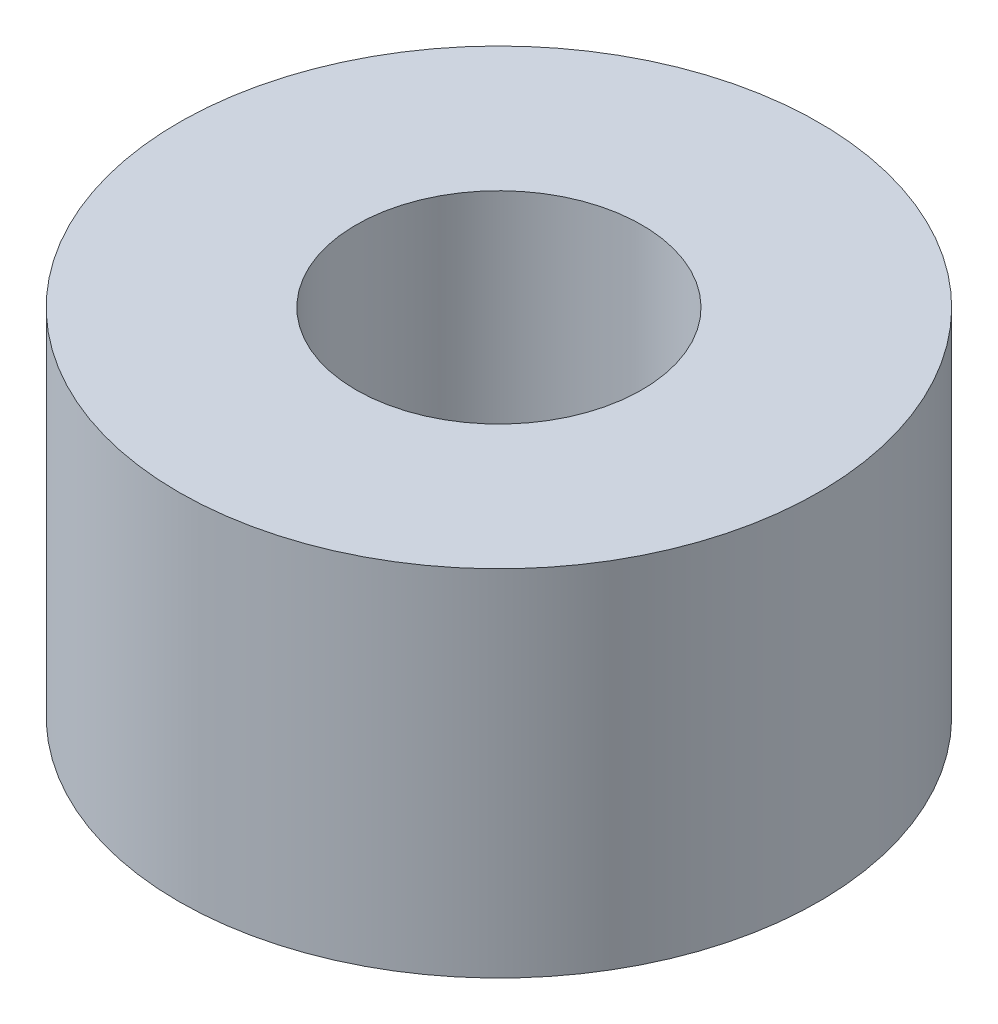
ISO-10303-21;
HEADER;
FILE_DESCRIPTION(('STEP AP214'),'2;1');
FILE_NAME('part.step','',(''),(''),'','','');
FILE_SCHEMA(('AUTOMOTIVE_DESIGN { 1 0 10303 214 1 1 1 1 }'));
ENDSEC;
DATA;
#1=APPLICATION_CONTEXT('core data for automotive mechanical design processes');
#2=APPLICATION_PROTOCOL_DEFINITION('international standard','automotive_design',2000,#1);
#3=PRODUCT_CONTEXT('',#1,'mechanical');
#4=PRODUCT('Part','Part','',(#3));
#5=PRODUCT_RELATED_PRODUCT_CATEGORY('part','',(#4));
#6=PRODUCT_DEFINITION_FORMATION('','',#4);
#7=PRODUCT_DEFINITION_CONTEXT('part definition',#1,'design');
#8=PRODUCT_DEFINITION('design','',#6,#7);
#9=PRODUCT_DEFINITION_SHAPE('','',#8);
#10=(LENGTH_UNIT() NAMED_UNIT(*) SI_UNIT(.MILLI.,.METRE.));
#11=(NAMED_UNIT(*) PLANE_ANGLE_UNIT() SI_UNIT($,.RADIAN.));
#12=(NAMED_UNIT(*) SI_UNIT($,.STERADIAN.) SOLID_ANGLE_UNIT());
#13=UNCERTAINTY_MEASURE_WITH_UNIT(LENGTH_MEASURE(1.E-05),#10,'distance_accuracy_value','');
#14=(GEOMETRIC_REPRESENTATION_CONTEXT(3) GLOBAL_UNCERTAINTY_ASSIGNED_CONTEXT((#13)) GLOBAL_UNIT_ASSIGNED_CONTEXT((#10,
#11,#12)) REPRESENTATION_CONTEXT('',''));
#15=CARTESIAN_POINT('',(0.,0.,0.));
#16=DIRECTION('',(0.,0.,1.));
#17=DIRECTION('',(1.,0.,0.));
#18=AXIS2_PLACEMENT_3D('',#15,#16,#17);
#19=CARTESIAN_POINT('',(0.,15.5,0.));
#20=DIRECTION('',(0.,1.,0.));
#21=DIRECTION('',(0.,0.,1.));
#22=AXIS2_PLACEMENT_3D('',#19,#20,#21);
#23=PLANE('',#22);
#24=CARTESIAN_POINT('',(0.,15.5,0.));
#25=DIRECTION('',(0.,1.,0.));
#26=DIRECTION('',(0.,0.,1.));
#27=AXIS2_PLACEMENT_3D('',#24,#25,#26);
#28=CIRCLE('',#27,14.);
#29=CARTESIAN_POINT('',(0.,15.5,14.));
#30=VERTEX_POINT('',#29);
#31=EDGE_CURVE('E10',#30,#30,#28,.T.);
#32=ORIENTED_EDGE('',*,*,#31,.T.);
#33=EDGE_LOOP('',(#32));
#34=FACE_BOUND('',#33,.T.);
#35=CARTESIAN_POINT('',(0.,15.5,0.));
#36=DIRECTION('',(0.,1.,0.));
#37=DIRECTION('',(0.,0.,1.));
#38=AXIS2_PLACEMENT_3D('',#35,#36,#37);
#39=CIRCLE('',#38,6.25);
#40=CARTESIAN_POINT('',(0.,15.5,6.25));
#41=VERTEX_POINT('',#40);
#42=EDGE_CURVE('E26',#41,#41,#39,.T.);
#43=ORIENTED_EDGE('',*,*,#42,.F.);
#44=EDGE_LOOP('',(#43));
#45=FACE_BOUND('',#44,.T.);
#46=ADVANCED_FACE('F15',(#34,#45),#23,.T.);
#47=CARTESIAN_POINT('',(0.,0.,0.));
#48=DIRECTION('',(0.,1.,0.));
#49=DIRECTION('',(0.,0.,1.));
#50=AXIS2_PLACEMENT_3D('',#47,#48,#49);
#51=PLANE('',#50);
#52=CARTESIAN_POINT('',(0.,0.,0.));
#53=DIRECTION('',(0.,1.,0.));
#54=DIRECTION('',(0.,0.,1.));
#55=AXIS2_PLACEMENT_3D('',#52,#53,#54);
#56=CIRCLE('',#55,14.);
#57=CARTESIAN_POINT('',(0.,0.,14.));
#58=VERTEX_POINT('',#57);
#59=EDGE_CURVE('E22',#58,#58,#56,.T.);
#60=ORIENTED_EDGE('',*,*,#59,.F.);
#61=EDGE_LOOP('',(#60));
#62=FACE_BOUND('',#61,.T.);
#63=CARTESIAN_POINT('',(0.,0.,0.));
#64=DIRECTION('',(0.,1.,0.));
#65=DIRECTION('',(0.,0.,1.));
#66=AXIS2_PLACEMENT_3D('',#63,#64,#65);
#67=CIRCLE('',#66,6.25);
#68=CARTESIAN_POINT('',(0.,0.,6.25));
#69=VERTEX_POINT('',#68);
#70=EDGE_CURVE('E30',#69,#69,#67,.T.);
#71=ORIENTED_EDGE('',*,*,#70,.T.);
#72=EDGE_LOOP('',(#71));
#73=FACE_BOUND('',#72,.T.);
#74=ADVANCED_FACE('F36',(#62,#73),#51,.F.);
#75=CARTESIAN_POINT('',(0.,15.5,0.));
#76=DIRECTION('',(0.,-1.,0.));
#77=DIRECTION('',(0.,0.,-1.));
#78=AXIS2_PLACEMENT_3D('',#75,#76,#77);
#79=CYLINDRICAL_SURFACE('',#78,14.);
#80=ORIENTED_EDGE('',*,*,#31,.F.);
#81=EDGE_LOOP('',(#80));
#82=FACE_BOUND('',#81,.T.);
#83=ORIENTED_EDGE('',*,*,#59,.T.);
#84=EDGE_LOOP('',(#83));
#85=FACE_BOUND('',#84,.T.);
#86=ADVANCED_FACE('F17',(#82,#85),#79,.T.);
#87=CARTESIAN_POINT('',(0.,15.5,0.));
#88=DIRECTION('',(0.,-1.,0.));
#89=DIRECTION('',(0.,0.,-1.));
#90=AXIS2_PLACEMENT_3D('',#87,#88,#89);
#91=CYLINDRICAL_SURFACE('',#90,6.25);
#92=ORIENTED_EDGE('',*,*,#42,.T.);
#93=EDGE_LOOP('',(#92));
#94=FACE_BOUND('',#93,.T.);
#95=ORIENTED_EDGE('',*,*,#70,.F.);
#96=EDGE_LOOP('',(#95));
#97=FACE_BOUND('',#96,.T.);
#98=ADVANCED_FACE('F38',(#94,#97),#91,.F.);
#99=CLOSED_SHELL('',(#46,#74,#86,#98));
#100=MANIFOLD_SOLID_BREP('B1',#99);
#101=ADVANCED_BREP_SHAPE_REPRESENTATION('',(#18,#100),#14);
#102=SHAPE_DEFINITION_REPRESENTATION(#9,#101);
ENDSEC;
END-ISO-10303-21;
